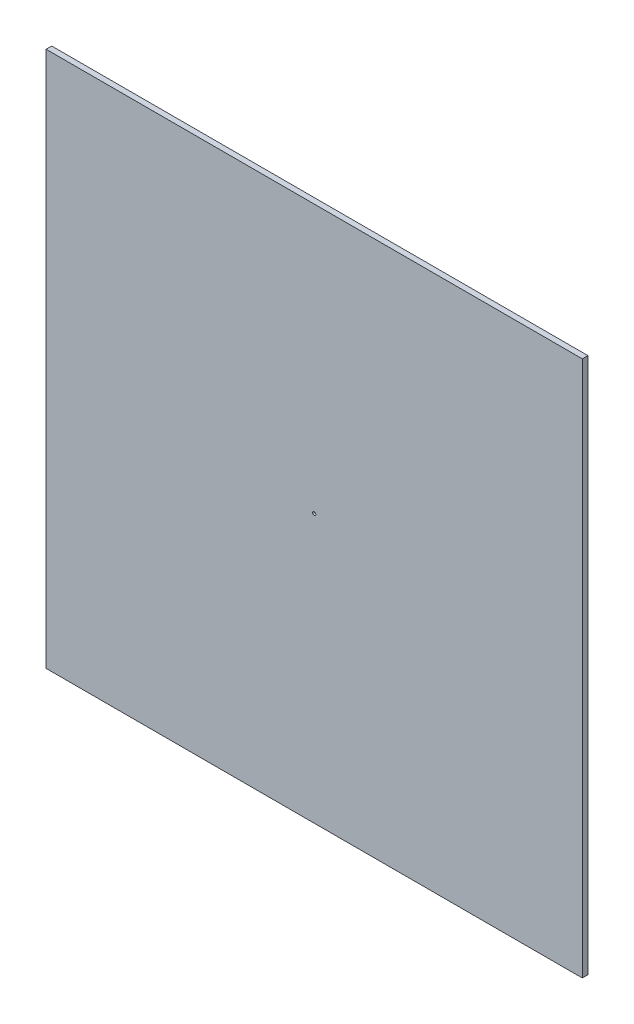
ISO-10303-21;
HEADER;
FILE_DESCRIPTION(('STEP AP214'),'2;1');
FILE_NAME('part.step','',(''),(''),'','','');
FILE_SCHEMA(('AUTOMOTIVE_DESIGN { 1 0 10303 214 1 1 1 1 }'));
ENDSEC;
DATA;
#1=APPLICATION_CONTEXT('core data for automotive mechanical design processes');
#2=APPLICATION_PROTOCOL_DEFINITION('international standard','automotive_design',2000,#1);
#3=PRODUCT_CONTEXT('',#1,'mechanical');
#4=PRODUCT('Part','Part','',(#3));
#5=PRODUCT_RELATED_PRODUCT_CATEGORY('part','',(#4));
#6=PRODUCT_DEFINITION_FORMATION('','',#4);
#7=PRODUCT_DEFINITION_CONTEXT('part definition',#1,'design');
#8=PRODUCT_DEFINITION('design','',#6,#7);
#9=PRODUCT_DEFINITION_SHAPE('','',#8);
#10=(LENGTH_UNIT() NAMED_UNIT(*) SI_UNIT(.MILLI.,.METRE.));
#11=(NAMED_UNIT(*) PLANE_ANGLE_UNIT() SI_UNIT($,.RADIAN.));
#12=(NAMED_UNIT(*) SI_UNIT($,.STERADIAN.) SOLID_ANGLE_UNIT());
#13=UNCERTAINTY_MEASURE_WITH_UNIT(LENGTH_MEASURE(1.E-05),#10,'distance_accuracy_value','');
#14=(GEOMETRIC_REPRESENTATION_CONTEXT(3) GLOBAL_UNCERTAINTY_ASSIGNED_CONTEXT((#13)) GLOBAL_UNIT_ASSIGNED_CONTEXT((#10,
#11,#12)) REPRESENTATION_CONTEXT('',''));
#15=CARTESIAN_POINT('',(0.,0.,0.));
#16=DIRECTION('',(0.,0.,1.));
#17=DIRECTION('',(1.,0.,0.));
#18=AXIS2_PLACEMENT_3D('',#15,#16,#17);
#19=CARTESIAN_POINT('',(0.,0.,2.794));
#20=DIRECTION('',(1.,0.,0.));
#21=DIRECTION('',(0.,0.,-1.));
#22=AXIS2_PLACEMENT_3D('',#19,#20,#21);
#23=PLANE('',#22);
#24=DIRECTION('',(0.,-1.,0.));
#25=VECTOR('',#24,1.);
#26=CARTESIAN_POINT('',(0.,0.,0.));
#27=LINE('',#26,#25);
#28=CARTESIAN_POINT('',(0.,0.,0.));
#29=VERTEX_POINT('',#28);
#30=CARTESIAN_POINT('',(0.,-266.7,0.));
#31=VERTEX_POINT('',#30);
#32=EDGE_CURVE('E100',#29,#31,#27,.T.);
#33=ORIENTED_EDGE('',*,*,#32,.T.);
#34=DIRECTION('',(0.,0.,-1.));
#35=VECTOR('',#34,1.);
#36=CARTESIAN_POINT('',(0.,-266.7,2.794));
#37=LINE('',#36,#35);
#38=CARTESIAN_POINT('',(0.,-266.7,2.794));
#39=VERTEX_POINT('',#38);
#40=EDGE_CURVE('E11',#39,#31,#37,.T.);
#41=ORIENTED_EDGE('',*,*,#40,.F.);
#42=DIRECTION('',(0.,-1.,0.));
#43=VECTOR('',#42,1.);
#44=CARTESIAN_POINT('',(0.,0.,2.794));
#45=LINE('',#44,#43);
#46=CARTESIAN_POINT('',(0.,0.,2.794));
#47=VERTEX_POINT('',#46);
#48=EDGE_CURVE('E88',#47,#39,#45,.T.);
#49=ORIENTED_EDGE('',*,*,#48,.F.);
#50=DIRECTION('',(0.,0.,-1.));
#51=VECTOR('',#50,1.);
#52=CARTESIAN_POINT('',(0.,0.,2.794));
#53=LINE('',#52,#51);
#54=EDGE_CURVE('E96',#47,#29,#53,.T.);
#55=ORIENTED_EDGE('',*,*,#54,.T.);
#56=EDGE_LOOP('',(#33,#41,#49,#55));
#57=FACE_BOUND('',#56,.T.);
#58=ADVANCED_FACE('F37',(#57),#23,.F.);
#59=CARTESIAN_POINT('',(0.,-266.7,2.794));
#60=DIRECTION('',(0.,1.,0.));
#61=DIRECTION('',(0.,0.,1.));
#62=AXIS2_PLACEMENT_3D('',#59,#60,#61);
#63=PLANE('',#62);
#64=DIRECTION('',(1.,0.,0.));
#65=VECTOR('',#64,1.);
#66=CARTESIAN_POINT('',(0.,-266.7,0.));
#67=LINE('',#66,#65);
#68=CARTESIAN_POINT('',(266.7,-266.7,0.));
#69=VERTEX_POINT('',#68);
#70=EDGE_CURVE('E92',#31,#69,#67,.T.);
#71=ORIENTED_EDGE('',*,*,#70,.T.);
#72=DIRECTION('',(0.,0.,-1.));
#73=VECTOR('',#72,1.);
#74=CARTESIAN_POINT('',(266.7,-266.7,2.794));
#75=LINE('',#74,#73);
#76=CARTESIAN_POINT('',(266.7,-266.7,2.794));
#77=VERTEX_POINT('',#76);
#78=EDGE_CURVE('E45',#77,#69,#75,.T.);
#79=ORIENTED_EDGE('',*,*,#78,.F.);
#80=DIRECTION('',(1.,0.,0.));
#81=VECTOR('',#80,1.);
#82=CARTESIAN_POINT('',(0.,-266.7,2.794));
#83=LINE('',#82,#81);
#84=EDGE_CURVE('E83',#39,#77,#83,.T.);
#85=ORIENTED_EDGE('',*,*,#84,.F.);
#86=ORIENTED_EDGE('',*,*,#40,.T.);
#87=EDGE_LOOP('',(#71,#79,#85,#86));
#88=FACE_BOUND('',#87,.T.);
#89=ADVANCED_FACE('F91',(#88),#63,.F.);
#90=CARTESIAN_POINT('',(266.7,0.,2.794));
#91=DIRECTION('',(-1.,0.,0.));
#92=DIRECTION('',(0.,0.,1.));
#93=AXIS2_PLACEMENT_3D('',#90,#91,#92);
#94=PLANE('',#93);
#95=DIRECTION('',(0.,1.,0.));
#96=VECTOR('',#95,1.);
#97=CARTESIAN_POINT('',(266.7,0.,0.));
#98=LINE('',#97,#96);
#99=CARTESIAN_POINT('',(266.7,0.,0.));
#100=VERTEX_POINT('',#99);
#101=EDGE_CURVE('E70',#69,#100,#98,.T.);
#102=ORIENTED_EDGE('',*,*,#101,.T.);
#103=DIRECTION('',(0.,0.,-1.));
#104=VECTOR('',#103,1.);
#105=CARTESIAN_POINT('',(266.7,0.,2.794));
#106=LINE('',#105,#104);
#107=CARTESIAN_POINT('',(266.7,0.,2.794));
#108=VERTEX_POINT('',#107);
#109=EDGE_CURVE('E93',#108,#100,#106,.T.);
#110=ORIENTED_EDGE('',*,*,#109,.F.);
#111=DIRECTION('',(0.,1.,0.));
#112=VECTOR('',#111,1.);
#113=CARTESIAN_POINT('',(266.7,0.,2.794));
#114=LINE('',#113,#112);
#115=EDGE_CURVE('E86',#77,#108,#114,.T.);
#116=ORIENTED_EDGE('',*,*,#115,.F.);
#117=ORIENTED_EDGE('',*,*,#78,.T.);
#118=EDGE_LOOP('',(#102,#110,#116,#117));
#119=FACE_BOUND('',#118,.T.);
#120=ADVANCED_FACE('F94',(#119),#94,.F.);
#121=CARTESIAN_POINT('',(0.,0.,2.794));
#122=DIRECTION('',(0.,-1.,0.));
#123=DIRECTION('',(0.,0.,-1.));
#124=AXIS2_PLACEMENT_3D('',#121,#122,#123);
#125=PLANE('',#124);
#126=DIRECTION('',(-1.,0.,0.));
#127=VECTOR('',#126,1.);
#128=CARTESIAN_POINT('',(0.,0.,0.));
#129=LINE('',#128,#127);
#130=EDGE_CURVE('E76',#100,#29,#129,.T.);
#131=ORIENTED_EDGE('',*,*,#130,.T.);
#132=ORIENTED_EDGE('',*,*,#54,.F.);
#133=DIRECTION('',(-1.,0.,0.));
#134=VECTOR('',#133,1.);
#135=CARTESIAN_POINT('',(0.,0.,2.794));
#136=LINE('',#135,#134);
#137=EDGE_CURVE('E53',#108,#47,#136,.T.);
#138=ORIENTED_EDGE('',*,*,#137,.F.);
#139=ORIENTED_EDGE('',*,*,#109,.T.);
#140=EDGE_LOOP('',(#131,#132,#138,#139));
#141=FACE_BOUND('',#140,.T.);
#142=ADVANCED_FACE('F108',(#141),#125,.F.);
#143=CARTESIAN_POINT('',(0.,0.,2.794));
#144=DIRECTION('',(0.,0.,1.));
#145=DIRECTION('',(1.,0.,0.));
#146=AXIS2_PLACEMENT_3D('',#143,#144,#145);
#147=PLANE('',#146);
#148=CARTESIAN_POINT('',(133.35,-133.35,2.794));
#149=DIRECTION('',(0.,0.,1.));
#150=DIRECTION('',(1.,0.,0.));
#151=AXIS2_PLACEMENT_3D('',#148,#149,#150);
#152=CIRCLE('',#151,0.793749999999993);
#153=CARTESIAN_POINT('',(134.14375,-133.35,2.794));
#154=VERTEX_POINT('',#153);
#155=EDGE_CURVE('E114',#154,#154,#152,.T.);
#156=ORIENTED_EDGE('',*,*,#155,.F.);
#157=EDGE_LOOP('',(#156));
#158=FACE_BOUND('',#157,.T.);
#159=ORIENTED_EDGE('',*,*,#48,.T.);
#160=ORIENTED_EDGE('',*,*,#84,.T.);
#161=ORIENTED_EDGE('',*,*,#115,.T.);
#162=ORIENTED_EDGE('',*,*,#137,.T.);
#163=EDGE_LOOP('',(#159,#160,#161,#162));
#164=FACE_BOUND('',#163,.T.);
#165=ADVANCED_FACE('F84',(#158,#164),#147,.T.);
#166=CARTESIAN_POINT('',(0.,0.,0.));
#167=DIRECTION('',(0.,0.,1.));
#168=DIRECTION('',(1.,0.,0.));
#169=AXIS2_PLACEMENT_3D('',#166,#167,#168);
#170=PLANE('',#169);
#171=CARTESIAN_POINT('',(133.35,-133.35,0.));
#172=DIRECTION('',(0.,0.,1.));
#173=DIRECTION('',(1.,0.,0.));
#174=AXIS2_PLACEMENT_3D('',#171,#172,#173);
#175=CIRCLE('',#174,0.793749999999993);
#176=CARTESIAN_POINT('',(134.14375,-133.35,0.));
#177=VERTEX_POINT('',#176);
#178=EDGE_CURVE('E103',#177,#177,#175,.T.);
#179=ORIENTED_EDGE('',*,*,#178,.T.);
#180=EDGE_LOOP('',(#179));
#181=FACE_BOUND('',#180,.T.);
#182=ORIENTED_EDGE('',*,*,#32,.F.);
#183=ORIENTED_EDGE('',*,*,#130,.F.);
#184=ORIENTED_EDGE('',*,*,#101,.F.);
#185=ORIENTED_EDGE('',*,*,#70,.F.);
#186=EDGE_LOOP('',(#182,#183,#184,#185));
#187=FACE_BOUND('',#186,.T.);
#188=ADVANCED_FACE('F111',(#181,#187),#170,.F.);
#189=CARTESIAN_POINT('',(133.35,-133.35,0.));
#190=DIRECTION('',(0.,0.,1.));
#191=DIRECTION('',(1.,0.,0.));
#192=AXIS2_PLACEMENT_3D('',#189,#190,#191);
#193=CYLINDRICAL_SURFACE('',#192,0.793749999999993);
#194=ORIENTED_EDGE('',*,*,#178,.F.);
#195=EDGE_LOOP('',(#194));
#196=FACE_BOUND('',#195,.T.);
#197=ORIENTED_EDGE('',*,*,#155,.T.);
#198=EDGE_LOOP('',(#197));
#199=FACE_BOUND('',#198,.T.);
#200=ADVANCED_FACE('F123',(#196,#199),#193,.F.);
#201=CLOSED_SHELL('',(#58,#89,#120,#142,#165,#188,#200));
#202=MANIFOLD_SOLID_BREP('B2',#201);
#203=ADVANCED_BREP_SHAPE_REPRESENTATION('',(#18,#202),#14);
#204=SHAPE_DEFINITION_REPRESENTATION(#9,#203);
ENDSEC;
END-ISO-10303-21;
